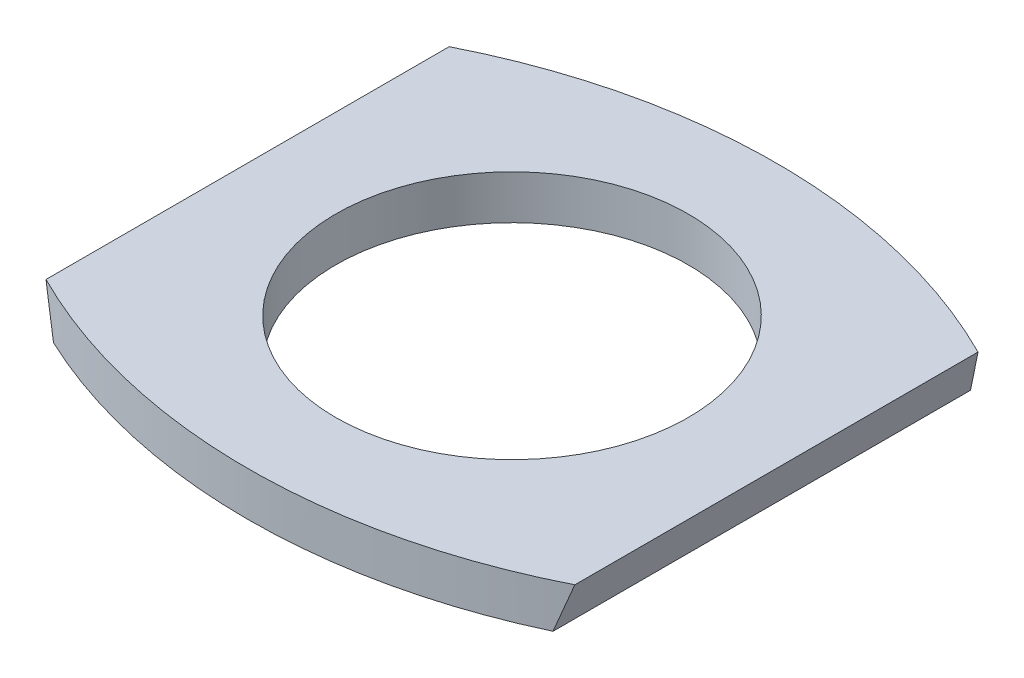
ISO-10303-21;
HEADER;
FILE_DESCRIPTION(('STEP AP214'),'2;1');
FILE_NAME('part.step','',(''),(''),'','','');
FILE_SCHEMA(('AUTOMOTIVE_DESIGN { 1 0 10303 214 1 1 1 1 }'));
ENDSEC;
DATA;
#1=APPLICATION_CONTEXT('core data for automotive mechanical design processes');
#2=APPLICATION_PROTOCOL_DEFINITION('international standard','automotive_design',2000,#1);
#3=PRODUCT_CONTEXT('',#1,'mechanical');
#4=PRODUCT('Part','Part','',(#3));
#5=PRODUCT_RELATED_PRODUCT_CATEGORY('part','',(#4));
#6=PRODUCT_DEFINITION_FORMATION('','',#4);
#7=PRODUCT_DEFINITION_CONTEXT('part definition',#1,'design');
#8=PRODUCT_DEFINITION('design','',#6,#7);
#9=PRODUCT_DEFINITION_SHAPE('','',#8);
#10=(LENGTH_UNIT() NAMED_UNIT(*) SI_UNIT(.MILLI.,.METRE.));
#11=(NAMED_UNIT(*) PLANE_ANGLE_UNIT() SI_UNIT($,.RADIAN.));
#12=(NAMED_UNIT(*) SI_UNIT($,.STERADIAN.) SOLID_ANGLE_UNIT());
#13=UNCERTAINTY_MEASURE_WITH_UNIT(LENGTH_MEASURE(1.E-05),#10,'distance_accuracy_value','');
#14=(GEOMETRIC_REPRESENTATION_CONTEXT(3) GLOBAL_UNCERTAINTY_ASSIGNED_CONTEXT((#13)) GLOBAL_UNIT_ASSIGNED_CONTEXT((#10,
#11,#12)) REPRESENTATION_CONTEXT('',''));
#15=CARTESIAN_POINT('',(0.,0.,0.));
#16=DIRECTION('',(0.,0.,1.));
#17=DIRECTION('',(1.,0.,0.));
#18=AXIS2_PLACEMENT_3D('',#15,#16,#17);
#19=CARTESIAN_POINT('',(0.,3.,22.));
#20=DIRECTION('',(0.,1.,0.));
#21=DIRECTION('',(0.,0.,1.));
#22=AXIS2_PLACEMENT_3D('',#19,#20,#21);
#23=PLANE('',#22);
#24=CARTESIAN_POINT('',(0.,3.,22.));
#25=DIRECTION('',(0.,1.,0.));
#26=DIRECTION('',(0.,0.,1.));
#27=AXIS2_PLACEMENT_3D('',#24,#25,#26);
#28=CIRCLE('',#27,40.);
#29=CARTESIAN_POINT('',(18.,3.,-13.7211421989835));
#30=VERTEX_POINT('',#29);
#31=CARTESIAN_POINT('',(-18.,3.,-13.7211421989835));
#32=VERTEX_POINT('',#31);
#33=EDGE_CURVE('E71',#30,#32,#28,.T.);
#34=ORIENTED_EDGE('',*,*,#33,.T.);
#35=DIRECTION('',(0.,0.,1.));
#36=VECTOR('',#35,1.);
#37=CARTESIAN_POINT('',(-18.,3.,-13.7211421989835));
#38=LINE('',#37,#36);
#39=CARTESIAN_POINT('',(-18.,3.,13.7211421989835));
#40=VERTEX_POINT('',#39);
#41=EDGE_CURVE('E80',#32,#40,#38,.T.);
#42=ORIENTED_EDGE('',*,*,#41,.T.);
#43=CARTESIAN_POINT('',(0.,3.,-22.));
#44=DIRECTION('',(0.,1.,0.));
#45=DIRECTION('',(0.,0.,1.));
#46=AXIS2_PLACEMENT_3D('',#43,#44,#45);
#47=CIRCLE('',#46,40.);
#48=CARTESIAN_POINT('',(18.,3.,13.7211421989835));
#49=VERTEX_POINT('',#48);
#50=EDGE_CURVE('E88',#40,#49,#47,.T.);
#51=ORIENTED_EDGE('',*,*,#50,.T.);
#52=DIRECTION('',(0.,0.,-1.));
#53=VECTOR('',#52,1.);
#54=CARTESIAN_POINT('',(18.,3.,-13.7211421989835));
#55=LINE('',#54,#53);
#56=EDGE_CURVE('E83',#49,#30,#55,.T.);
#57=ORIENTED_EDGE('',*,*,#56,.T.);
#58=EDGE_LOOP('',(#34,#42,#51,#57));
#59=FACE_BOUND('',#58,.T.);
#60=CARTESIAN_POINT('',(0.,3.,0.));
#61=DIRECTION('',(0.,1.,0.));
#62=DIRECTION('',(0.,0.,1.));
#63=AXIS2_PLACEMENT_3D('',#60,#61,#62);
#64=CIRCLE('',#63,12.);
#65=CARTESIAN_POINT('',(0.,3.,12.));
#66=VERTEX_POINT('',#65);
#67=EDGE_CURVE('E96',#66,#66,#64,.T.);
#68=ORIENTED_EDGE('',*,*,#67,.F.);
#69=EDGE_LOOP('',(#68));
#70=FACE_BOUND('',#69,.T.);
#71=ADVANCED_FACE('F31',(#59,#70),#23,.T.);
#72=CARTESIAN_POINT('',(0.,0.,22.));
#73=DIRECTION('',(0.,1.,0.));
#74=DIRECTION('',(0.,0.,1.));
#75=AXIS2_PLACEMENT_3D('',#72,#73,#74);
#76=PLANE('',#75);
#77=CARTESIAN_POINT('',(0.,0.,-22.));
#78=DIRECTION('',(0.,1.,0.));
#79=DIRECTION('',(0.,0.,1.));
#80=AXIS2_PLACEMENT_3D('',#77,#78,#79);
#81=CIRCLE('',#80,40.);
#82=CARTESIAN_POINT('',(-17.,0.,14.2077339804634));
#83=VERTEX_POINT('',#82);
#84=CARTESIAN_POINT('',(17.,0.,14.2077339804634));
#85=VERTEX_POINT('',#84);
#86=EDGE_CURVE('E84',#83,#85,#81,.T.);
#87=ORIENTED_EDGE('',*,*,#86,.F.);
#88=DIRECTION('',(0.,0.,-1.));
#89=VECTOR('',#88,1.);
#90=CARTESIAN_POINT('',(-17.,0.,22.));
#91=LINE('',#90,#89);
#92=CARTESIAN_POINT('',(-17.,0.,-14.2077339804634));
#93=VERTEX_POINT('',#92);
#94=EDGE_CURVE('E46',#83,#93,#91,.T.);
#95=ORIENTED_EDGE('',*,*,#94,.T.);
#96=CARTESIAN_POINT('',(0.,0.,22.));
#97=DIRECTION('',(0.,1.,0.));
#98=DIRECTION('',(0.,0.,1.));
#99=AXIS2_PLACEMENT_3D('',#96,#97,#98);
#100=CIRCLE('',#99,40.);
#101=CARTESIAN_POINT('',(17.,0.,-14.2077339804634));
#102=VERTEX_POINT('',#101);
#103=EDGE_CURVE('E72',#102,#93,#100,.T.);
#104=ORIENTED_EDGE('',*,*,#103,.F.);
#105=DIRECTION('',(0.,0.,1.));
#106=VECTOR('',#105,1.);
#107=CARTESIAN_POINT('',(17.,0.,22.));
#108=LINE('',#107,#106);
#109=EDGE_CURVE('E101',#102,#85,#108,.T.);
#110=ORIENTED_EDGE('',*,*,#109,.T.);
#111=EDGE_LOOP('',(#87,#95,#104,#110));
#112=FACE_BOUND('',#111,.T.);
#113=CARTESIAN_POINT('',(0.,0.,0.));
#114=DIRECTION('',(0.,1.,0.));
#115=DIRECTION('',(0.,0.,1.));
#116=AXIS2_PLACEMENT_3D('',#113,#114,#115);
#117=CIRCLE('',#116,12.);
#118=CARTESIAN_POINT('',(0.,0.,12.));
#119=VERTEX_POINT('',#118);
#120=EDGE_CURVE('E171',#119,#119,#117,.T.);
#121=ORIENTED_EDGE('',*,*,#120,.T.);
#122=EDGE_LOOP('',(#121));
#123=FACE_BOUND('',#122,.T.);
#124=ADVANCED_FACE('F104',(#112,#123),#76,.F.);
#125=CARTESIAN_POINT('',(0.,3.,22.));
#126=DIRECTION('',(0.,-1.,0.));
#127=DIRECTION('',(0.,0.,-1.));
#128=AXIS2_PLACEMENT_3D('',#125,#126,#127);
#129=CYLINDRICAL_SURFACE('',#128,40.);
#130=ORIENTED_EDGE('',*,*,#103,.T.);
#131=CARTESIAN_POINT('',(0.,-51.0000000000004,22.));
#132=DIRECTION('',(0.948683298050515,0.316227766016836,0.));
#133=DIRECTION('',(0.316227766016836,-0.948683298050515,0.));
#134=AXIS2_PLACEMENT_3D('',#131,#132,#133);
#135=ELLIPSE('',#134,126.491106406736,40.);
#136=EDGE_CURVE('E11',#93,#32,#135,.T.);
#137=ORIENTED_EDGE('',*,*,#136,.T.);
#138=ORIENTED_EDGE('',*,*,#33,.F.);
#139=CARTESIAN_POINT('',(0.,-51.0000000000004,22.));
#140=DIRECTION('',(-0.948683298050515,0.316227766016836,0.));
#141=DIRECTION('',(-0.316227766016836,-0.948683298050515,0.));
#142=AXIS2_PLACEMENT_3D('',#139,#140,#141);
#143=ELLIPSE('',#142,126.491106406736,40.);
#144=EDGE_CURVE('E39',#30,#102,#143,.T.);
#145=ORIENTED_EDGE('',*,*,#144,.T.);
#146=EDGE_LOOP('',(#130,#137,#138,#145));
#147=FACE_BOUND('',#146,.T.);
#148=ADVANCED_FACE('F70',(#147),#129,.T.);
#149=CARTESIAN_POINT('',(0.,3.,-22.));
#150=DIRECTION('',(0.,-1.,0.));
#151=DIRECTION('',(0.,0.,-1.));
#152=AXIS2_PLACEMENT_3D('',#149,#150,#151);
#153=CYLINDRICAL_SURFACE('',#152,40.);
#154=ORIENTED_EDGE('',*,*,#50,.F.);
#155=CARTESIAN_POINT('',(0.,-51.0000000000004,-22.));
#156=DIRECTION('',(0.948683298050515,0.316227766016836,0.));
#157=DIRECTION('',(0.316227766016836,-0.948683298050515,0.));
#158=AXIS2_PLACEMENT_3D('',#155,#156,#157);
#159=ELLIPSE('',#158,126.491106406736,40.);
#160=EDGE_CURVE('E87',#40,#83,#159,.T.);
#161=ORIENTED_EDGE('',*,*,#160,.T.);
#162=ORIENTED_EDGE('',*,*,#86,.T.);
#163=CARTESIAN_POINT('',(0.,-51.0000000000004,-22.));
#164=DIRECTION('',(-0.948683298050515,0.316227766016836,0.));
#165=DIRECTION('',(-0.316227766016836,-0.948683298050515,0.));
#166=AXIS2_PLACEMENT_3D('',#163,#164,#165);
#167=ELLIPSE('',#166,126.491106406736,40.);
#168=EDGE_CURVE('E94',#85,#49,#167,.T.);
#169=ORIENTED_EDGE('',*,*,#168,.T.);
#170=EDGE_LOOP('',(#154,#161,#162,#169));
#171=FACE_BOUND('',#170,.T.);
#172=ADVANCED_FACE('F109',(#171),#153,.T.);
#173=CARTESIAN_POINT('',(0.,3.,0.));
#174=DIRECTION('',(0.,-1.,0.));
#175=DIRECTION('',(0.,0.,-1.));
#176=AXIS2_PLACEMENT_3D('',#173,#174,#175);
#177=CYLINDRICAL_SURFACE('',#176,12.);
#178=ORIENTED_EDGE('',*,*,#67,.T.);
#179=EDGE_LOOP('',(#178));
#180=FACE_BOUND('',#179,.T.);
#181=ORIENTED_EDGE('',*,*,#120,.F.);
#182=EDGE_LOOP('',(#181));
#183=FACE_BOUND('',#182,.T.);
#184=ADVANCED_FACE('F114',(#180,#183),#177,.F.);
#185=CARTESIAN_POINT('',(-18.,3.00000000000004,-13.7211421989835));
#186=DIRECTION('',(0.948683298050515,0.316227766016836,0.));
#187=DIRECTION('',(-0.316227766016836,0.948683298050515,0.));
#188=AXIS2_PLACEMENT_3D('',#185,#186,#187);
#189=PLANE('',#188);
#190=ORIENTED_EDGE('',*,*,#136,.F.);
#191=ORIENTED_EDGE('',*,*,#94,.F.);
#192=ORIENTED_EDGE('',*,*,#160,.F.);
#193=ORIENTED_EDGE('',*,*,#41,.F.);
#194=EDGE_LOOP('',(#190,#191,#192,#193));
#195=FACE_BOUND('',#194,.T.);
#196=ADVANCED_FACE('F86',(#195),#189,.F.);
#197=CARTESIAN_POINT('',(18.,3.00000000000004,-13.7211421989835));
#198=DIRECTION('',(-0.948683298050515,0.316227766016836,0.));
#199=DIRECTION('',(-0.316227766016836,-0.948683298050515,0.));
#200=AXIS2_PLACEMENT_3D('',#197,#198,#199);
#201=PLANE('',#200);
#202=ORIENTED_EDGE('',*,*,#168,.F.);
#203=ORIENTED_EDGE('',*,*,#109,.F.);
#204=ORIENTED_EDGE('',*,*,#144,.F.);
#205=ORIENTED_EDGE('',*,*,#56,.F.);
#206=EDGE_LOOP('',(#202,#203,#204,#205));
#207=FACE_BOUND('',#206,.T.);
#208=ADVANCED_FACE('F33',(#207),#201,.F.);
#209=CLOSED_SHELL('',(#71,#124,#148,#172,#184,#196,#208));
#210=MANIFOLD_SOLID_BREP('B2',#209);
#211=ADVANCED_BREP_SHAPE_REPRESENTATION('',(#18,#210),#14);
#212=SHAPE_DEFINITION_REPRESENTATION(#9,#211);
ENDSEC;
END-ISO-10303-21;
